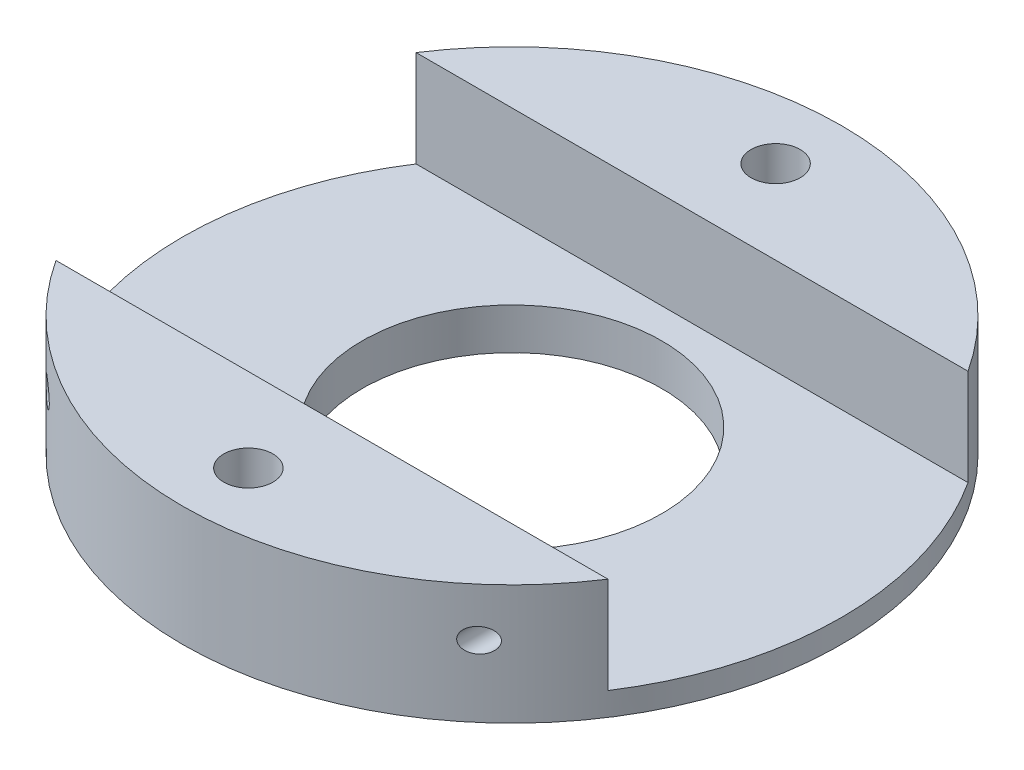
ISO-10303-21;
HEADER;
FILE_DESCRIPTION(('STEP AP214'),'2;1');
FILE_NAME('part.step','',(''),(''),'','','');
FILE_SCHEMA(('AUTOMOTIVE_DESIGN { 1 0 10303 214 1 1 1 1 }'));
ENDSEC;
DATA;
#1=APPLICATION_CONTEXT('core data for automotive mechanical design processes');
#2=APPLICATION_PROTOCOL_DEFINITION('international standard','automotive_design',2000,#1);
#3=PRODUCT_CONTEXT('',#1,'mechanical');
#4=PRODUCT('Part','Part','',(#3));
#5=PRODUCT_RELATED_PRODUCT_CATEGORY('part','',(#4));
#6=PRODUCT_DEFINITION_FORMATION('','',#4);
#7=PRODUCT_DEFINITION_CONTEXT('part definition',#1,'design');
#8=PRODUCT_DEFINITION('design','',#6,#7);
#9=PRODUCT_DEFINITION_SHAPE('','',#8);
#10=(LENGTH_UNIT() NAMED_UNIT(*) SI_UNIT(.MILLI.,.METRE.));
#11=(NAMED_UNIT(*) PLANE_ANGLE_UNIT() SI_UNIT($,.RADIAN.));
#12=(NAMED_UNIT(*) SI_UNIT($,.STERADIAN.) SOLID_ANGLE_UNIT());
#13=UNCERTAINTY_MEASURE_WITH_UNIT(LENGTH_MEASURE(1.E-05),#10,'distance_accuracy_value','');
#14=(GEOMETRIC_REPRESENTATION_CONTEXT(3) GLOBAL_UNCERTAINTY_ASSIGNED_CONTEXT((#13)) GLOBAL_UNIT_ASSIGNED_CONTEXT((#10,
#11,#12)) REPRESENTATION_CONTEXT('',''));
#15=CARTESIAN_POINT('',(0.,0.,0.));
#16=DIRECTION('',(0.,0.,1.));
#17=DIRECTION('',(1.,0.,0.));
#18=AXIS2_PLACEMENT_3D('',#15,#16,#17);
#19=CARTESIAN_POINT('',(0.,0.,0.));
#20=DIRECTION('',(0.,1.,0.));
#21=DIRECTION('',(0.,0.,1.));
#22=AXIS2_PLACEMENT_3D('',#19,#20,#21);
#23=PLANE('',#22);
#24=CARTESIAN_POINT('',(0.,0.,0.));
#25=DIRECTION('',(0.,1.,0.));
#26=DIRECTION('',(0.,0.,1.));
#27=AXIS2_PLACEMENT_3D('',#24,#25,#26);
#28=CIRCLE('',#27,27.5);
#29=CARTESIAN_POINT('',(0.,0.,27.5));
#30=VERTEX_POINT('',#29);
#31=EDGE_CURVE('E107',#30,#30,#28,.T.);
#32=ORIENTED_EDGE('',*,*,#31,.F.);
#33=EDGE_LOOP('',(#32));
#34=FACE_BOUND('',#33,.T.);
#35=CARTESIAN_POINT('',(0.,0.,22.));
#36=DIRECTION('',(0.,1.,0.));
#37=DIRECTION('',(0.,0.,1.));
#38=AXIS2_PLACEMENT_3D('',#35,#36,#37);
#39=CIRCLE('',#38,2.05);
#40=CARTESIAN_POINT('',(0.,0.,24.05));
#41=VERTEX_POINT('',#40);
#42=EDGE_CURVE('E187',#41,#41,#39,.T.);
#43=ORIENTED_EDGE('',*,*,#42,.T.);
#44=EDGE_LOOP('',(#43));
#45=FACE_BOUND('',#44,.T.);
#46=CARTESIAN_POINT('',(0.,0.,-22.));
#47=DIRECTION('',(0.,1.,0.));
#48=DIRECTION('',(0.,0.,1.));
#49=AXIS2_PLACEMENT_3D('',#46,#47,#48);
#50=CIRCLE('',#49,2.05);
#51=CARTESIAN_POINT('',(0.,0.,-19.95));
#52=VERTEX_POINT('',#51);
#53=EDGE_CURVE('E191',#52,#52,#50,.T.);
#54=ORIENTED_EDGE('',*,*,#53,.T.);
#55=EDGE_LOOP('',(#54));
#56=FACE_BOUND('',#55,.T.);
#57=CARTESIAN_POINT('',(0.,0.,0.));
#58=DIRECTION('',(0.,1.,0.));
#59=DIRECTION('',(0.,0.,1.));
#60=AXIS2_PLACEMENT_3D('',#57,#58,#59);
#61=CIRCLE('',#60,14.45);
#62=CARTESIAN_POINT('',(0.,0.,14.45));
#63=VERTEX_POINT('',#62);
#64=EDGE_CURVE('E11',#63,#63,#61,.F.);
#65=ORIENTED_EDGE('',*,*,#64,.F.);
#66=EDGE_LOOP('',(#65));
#67=FACE_BOUND('',#66,.T.);
#68=ADVANCED_FACE('F43',(#34,#45,#56,#67),#23,.F.);
#69=CARTESIAN_POINT('',(0.,10.,0.));
#70=DIRECTION('',(0.,-1.,0.));
#71=DIRECTION('',(0.,0.,-1.));
#72=AXIS2_PLACEMENT_3D('',#69,#70,#71);
#73=CYLINDRICAL_SURFACE('',#72,27.5);
#74=CARTESIAN_POINT('',(-19.,5.95,19.880895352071));
#75=CARTESIAN_POINT('',(-18.9999972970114,5.904632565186,19.8808980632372));
#76=CARTESIAN_POINT('',(-18.9968872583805,5.85924397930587,19.8838715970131));
#77=CARTESIAN_POINT('',(-18.984703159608,5.77001735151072,19.8955048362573));
#78=CARTESIAN_POINT('',(-18.9756234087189,5.72618083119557,19.9041699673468));
#79=CARTESIAN_POINT('',(-18.9522609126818,5.64159543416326,19.9264161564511));
#80=CARTESIAN_POINT('',(-18.9380125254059,5.60082826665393,19.9399647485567));
#81=CARTESIAN_POINT('',(-18.9051462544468,5.52279185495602,19.971128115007));
#82=CARTESIAN_POINT('',(-18.8865264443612,5.48552416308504,19.988744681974));
#83=CARTESIAN_POINT('',(-18.8376052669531,5.40075355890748,20.0348733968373));
#84=CARTESIAN_POINT('',(-18.8056031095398,5.3550742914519,20.0649324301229));
#85=CARTESIAN_POINT('',(-18.7364814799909,5.27135782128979,20.1294936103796));
#86=CARTESIAN_POINT('',(-18.6993512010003,5.2333371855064,20.1640051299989));
#87=CARTESIAN_POINT('',(-18.6083529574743,5.15331915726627,20.248066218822));
#88=CARTESIAN_POINT('',(-18.5530303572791,5.11421804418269,20.2987948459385));
#89=CARTESIAN_POINT('',(-18.4380587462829,5.04861690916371,20.4032852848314));
#90=CARTESIAN_POINT('',(-18.3784069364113,5.02212512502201,20.4570490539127));
#91=CARTESIAN_POINT('',(-18.2552200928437,4.98089882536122,20.5670581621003));
#92=CARTESIAN_POINT('',(-18.1916331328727,4.96639474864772,20.6233311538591));
#93=CARTESIAN_POINT('',(-18.0629951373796,4.94988035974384,20.7360925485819));
#94=CARTESIAN_POINT('',(-17.9979432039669,4.94787793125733,20.7925810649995));
#95=CARTESIAN_POINT('',(-17.8585120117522,4.95725823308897,20.9125117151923));
#96=CARTESIAN_POINT('',(-17.7841207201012,4.97058316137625,20.975801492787));
#97=CARTESIAN_POINT('',(-17.6377634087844,5.01479361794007,21.0990143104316));
#98=CARTESIAN_POINT('',(-17.5657941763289,5.04565482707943,21.1589418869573));
#99=CARTESIAN_POINT('',(-17.4496391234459,5.11329171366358,21.2547375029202));
#100=CARTESIAN_POINT('',(-17.4038723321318,5.14509950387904,21.2922148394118));
#101=CARTESIAN_POINT('',(-17.3166346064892,5.21772856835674,21.363223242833));
#102=CARTESIAN_POINT('',(-17.2751567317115,5.25853493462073,21.3967606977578));
#103=CARTESIAN_POINT('',(-17.2057268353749,5.34053785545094,21.4526121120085));
#104=CARTESIAN_POINT('',(-17.1767014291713,5.38019305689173,21.4758483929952));
#105=CARTESIAN_POINT('',(-17.1240134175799,5.46508898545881,21.5178832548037));
#106=CARTESIAN_POINT('',(-17.1003494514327,5.51032829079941,21.5366829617));
#107=CARTESIAN_POINT('',(-17.0595919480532,5.6059724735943,21.568982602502));
#108=CARTESIAN_POINT('',(-17.0425547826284,5.65641723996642,21.5824370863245));
#109=CARTESIAN_POINT('',(-17.0166373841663,5.76060763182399,21.6028778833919));
#110=CARTESIAN_POINT('',(-17.0077486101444,5.81434973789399,21.6098709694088));
#111=CARTESIAN_POINT('',(-16.9995058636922,5.9152885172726,21.6163553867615));
#112=CARTESIAN_POINT('',(-16.9989798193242,5.96233425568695,21.6167688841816));
#113=CARTESIAN_POINT('',(-17.0045113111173,6.05578574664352,21.6124179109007));
#114=CARTESIAN_POINT('',(-17.0105671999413,6.10219165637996,21.6076547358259));
#115=CARTESIAN_POINT('',(-17.0283906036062,6.19064254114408,21.5936108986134));
#116=CARTESIAN_POINT('',(-17.0398520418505,6.23278927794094,21.5845722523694));
#117=CARTESIAN_POINT('',(-17.0677231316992,6.31430289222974,21.5625402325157));
#118=CARTESIAN_POINT('',(-17.0841335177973,6.35366935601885,21.5495462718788));
#119=CARTESIAN_POINT('',(-17.1227160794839,6.4321206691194,21.5189044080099));
#120=CARTESIAN_POINT('',(-17.1452551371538,6.47090709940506,21.500958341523));
#121=CARTESIAN_POINT('',(-17.1943255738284,6.54399549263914,21.4617370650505));
#122=CARTESIAN_POINT('',(-17.2208595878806,6.57829446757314,21.4404596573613));
#123=CARTESIAN_POINT('',(-17.289619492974,6.65650401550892,21.3850827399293));
#124=CARTESIAN_POINT('',(-17.333561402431,6.69786687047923,21.3495004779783));
#125=CARTESIAN_POINT('',(-17.4258367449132,6.7708609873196,21.2742515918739));
#126=CARTESIAN_POINT('',(-17.4741789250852,6.80247229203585,21.2345768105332));
#127=CARTESIAN_POINT('',(-17.5865214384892,6.86329422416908,21.1416849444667));
#128=CARTESIAN_POINT('',(-17.651323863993,6.88974157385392,21.0876296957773));
#129=CARTESIAN_POINT('',(-17.782778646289,6.92852848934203,20.9768966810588));
#130=CARTESIAN_POINT('',(-17.8494316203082,6.94086328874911,20.9202180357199));
#131=CARTESIAN_POINT('',(-17.9835732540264,6.95215281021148,20.8050232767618));
#132=CARTESIAN_POINT('',(-18.05106286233,6.95095509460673,20.7464936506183));
#133=CARTESIAN_POINT('',(-18.1846478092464,6.93510645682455,20.6295050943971));
#134=CARTESIAN_POINT('',(-18.2507413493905,6.92043914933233,20.5710463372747));
#135=CARTESIAN_POINT('',(-18.3865936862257,6.87530749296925,20.4497503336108));
#136=CARTESIAN_POINT('',(-18.4560248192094,6.84336653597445,20.3870853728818));
#137=CARTESIAN_POINT('',(-18.5885039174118,6.76220076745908,20.2663633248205));
#138=CARTESIAN_POINT('',(-18.6515692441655,6.71302469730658,20.2082938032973));
#139=CARTESIAN_POINT('',(-18.7432652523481,6.62071374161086,20.1231750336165));
#140=CARTESIAN_POINT('',(-18.7753099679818,6.58357002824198,20.0932677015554));
#141=CARTESIAN_POINT('',(-18.8347127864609,6.5029487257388,20.0375955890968));
#142=CARTESIAN_POINT('',(-18.8620780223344,6.45948096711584,20.0118245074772));
#143=CARTESIAN_POINT('',(-18.9061683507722,6.37507654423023,19.9701664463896));
#144=CARTESIAN_POINT('',(-18.9239249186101,6.33514979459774,19.9533331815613));
#145=CARTESIAN_POINT('',(-18.9543951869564,6.25180988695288,19.9243907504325));
#146=CARTESIAN_POINT('',(-18.9671159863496,6.20840174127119,19.9122749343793));
#147=CARTESIAN_POINT('',(-18.9844591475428,6.12915799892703,19.8957387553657));
#148=CARTESIAN_POINT('',(-18.9902584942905,6.09381023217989,19.8902013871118));
#149=CARTESIAN_POINT('',(-18.9980299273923,6.02231277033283,19.8827786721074));
#150=CARTESIAN_POINT('',(-19.0000021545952,5.98616310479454,19.8808931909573));
#151=CARTESIAN_POINT('',(-19.,5.95,19.880895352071));
#152=B_SPLINE_CURVE_WITH_KNOTS('',3,(#74,#75,#76,#77,#78,#79,#80,#81,#82,#83,#84,#85,#86,#87,
#88,#89,#90,#91,#92,#93,#94,#95,#96,#97,#98,#99,#100,#101,#102,#103,#104,#105,#106,#107,#108,
#109,#110,#111,#112,#113,#114,#115,#116,#117,#118,#119,#120,#121,#122,#123,#124,#125,#126,#127,
#128,#129,#130,#131,#132,#133,#134,#135,#136,#137,#138,#139,#140,#141,#142,#143,#144,#145,#146,
#147,#148,#149,#150,#151),.UNSPECIFIED.,.T.,.F.,(4,2,2,2,2,2,2,2,2,2,2,2,2,2,2,2,2,2,2,2,2,2,2,
2,2,2,2,2,2,2,2,2,2,2,2,2,2,2,4),(0.,0.135944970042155,0.272019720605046,0.407206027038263,
0.542452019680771,0.73148350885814,0.920919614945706,1.17347759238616,1.42620034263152,
1.68367505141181,1.94131211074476,2.23555446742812,2.52938976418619,2.73017399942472,
2.93062806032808,3.09307022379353,3.25547111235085,3.41922475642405,3.58280656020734,
3.72322124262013,3.86360078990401,3.99684244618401,4.13010388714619,4.27450104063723,
4.41899385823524,4.62801217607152,4.83745546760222,5.10137821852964,5.36539008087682,
5.63237885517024,5.89969284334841,6.19464731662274,6.48877429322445,6.6605942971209,
6.83215001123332,6.97208866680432,7.11182934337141,7.2201972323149,7.32856113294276),.UNSPECIFIED.);
#153=CARTESIAN_POINT('',(-19.,5.95,19.880895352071));
#154=VERTEX_POINT('',#153);
#155=EDGE_CURVE('E118',#154,#154,#152,.T.);
#156=ORIENTED_EDGE('',*,*,#155,.F.);
#157=EDGE_LOOP('',(#156));
#158=FACE_BOUND('',#157,.T.);
#159=CARTESIAN_POINT('',(0.,1.95,0.));
#160=DIRECTION('',(0.,-1.,0.));
#161=DIRECTION('',(0.,0.,-1.));
#162=AXIS2_PLACEMENT_3D('',#159,#160,#161);
#163=CIRCLE('',#162,27.5);
#164=CARTESIAN_POINT('',(23.0325720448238,1.95,-15.025));
#165=VERTEX_POINT('',#164);
#166=CARTESIAN_POINT('',(23.0325720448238,1.95,15.025));
#167=VERTEX_POINT('',#166);
#168=EDGE_CURVE('E52',#165,#167,#163,.T.);
#169=ORIENTED_EDGE('',*,*,#168,.T.);
#170=DIRECTION('',(0.,-1.,0.));
#171=VECTOR('',#170,1.);
#172=CARTESIAN_POINT('',(23.0325720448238,10.,15.025));
#173=LINE('',#172,#171);
#174=CARTESIAN_POINT('',(23.0325720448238,10.,15.025));
#175=VERTEX_POINT('',#174);
#176=EDGE_CURVE('E67',#167,#175,#173,.F.);
#177=ORIENTED_EDGE('',*,*,#176,.T.);
#178=CARTESIAN_POINT('',(0.,10.,0.));
#179=DIRECTION('',(0.,1.,0.));
#180=DIRECTION('',(0.,0.,1.));
#181=AXIS2_PLACEMENT_3D('',#178,#179,#180);
#182=CIRCLE('',#181,27.5);
#183=CARTESIAN_POINT('',(-23.0325720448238,10.,15.025));
#184=VERTEX_POINT('',#183);
#185=EDGE_CURVE('E104',#184,#175,#182,.T.);
#186=ORIENTED_EDGE('',*,*,#185,.F.);
#187=DIRECTION('',(0.,-1.,0.));
#188=VECTOR('',#187,1.);
#189=CARTESIAN_POINT('',(-23.0325720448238,10.,15.025));
#190=LINE('',#189,#188);
#191=CARTESIAN_POINT('',(-23.0325720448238,1.95,15.025));
#192=VERTEX_POINT('',#191);
#193=EDGE_CURVE('E110',#184,#192,#190,.T.);
#194=ORIENTED_EDGE('',*,*,#193,.T.);
#195=CARTESIAN_POINT('',(-23.0325720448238,1.95,-15.025));
#196=VERTEX_POINT('',#195);
#197=EDGE_CURVE('E100',#192,#196,#163,.T.);
#198=ORIENTED_EDGE('',*,*,#197,.T.);
#199=DIRECTION('',(0.,-1.,0.));
#200=VECTOR('',#199,1.);
#201=CARTESIAN_POINT('',(-23.0325720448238,10.,-15.025));
#202=LINE('',#201,#200);
#203=CARTESIAN_POINT('',(-23.0325720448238,10.,-15.025));
#204=VERTEX_POINT('',#203);
#205=EDGE_CURVE('E87',#196,#204,#202,.F.);
#206=ORIENTED_EDGE('',*,*,#205,.T.);
#207=CARTESIAN_POINT('',(23.0325720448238,10.,-15.025));
#208=VERTEX_POINT('',#207);
#209=EDGE_CURVE('E93',#208,#204,#182,.T.);
#210=ORIENTED_EDGE('',*,*,#209,.F.);
#211=DIRECTION('',(0.,-1.,0.));
#212=VECTOR('',#211,1.);
#213=CARTESIAN_POINT('',(23.0325720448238,10.,-15.025));
#214=LINE('',#213,#212);
#215=EDGE_CURVE('E59',#208,#165,#214,.T.);
#216=ORIENTED_EDGE('',*,*,#215,.T.);
#217=EDGE_LOOP('',(#169,#177,#186,#194,#198,#206,#210,#216));
#218=FACE_BOUND('',#217,.T.);
#219=ORIENTED_EDGE('',*,*,#31,.T.);
#220=EDGE_LOOP('',(#219));
#221=FACE_BOUND('',#220,.T.);
#222=CARTESIAN_POINT('',(17.,5.95,21.6159663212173));
#223=CARTESIAN_POINT('',(17.0000066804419,5.90265618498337,21.6159613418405));
#224=CARTESIAN_POINT('',(17.0033903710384,5.85523664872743,21.6133013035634));
#225=CARTESIAN_POINT('',(17.0167216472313,5.76184350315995,21.6028065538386));
#226=CARTESIAN_POINT('',(17.0266869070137,5.71587413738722,21.5949579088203));
#227=CARTESIAN_POINT('',(17.0524802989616,5.62698903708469,21.5745957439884));
#228=CARTESIAN_POINT('',(17.0682778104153,5.58405872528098,21.5621065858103));
#229=CARTESIAN_POINT('',(17.1048770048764,5.5019162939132,21.5330844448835));
#230=CARTESIAN_POINT('',(17.1256771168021,5.46270301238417,21.5165527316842));
#231=CARTESIAN_POINT('',(17.1729970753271,5.38586938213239,21.4788069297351));
#232=CARTESIAN_POINT('',(17.1998175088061,5.34855810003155,21.4573442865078));
#233=CARTESIAN_POINT('',(17.2571266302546,5.27905099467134,21.4112806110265));
#234=CARTESIAN_POINT('',(17.287618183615,5.2468592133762,21.3866771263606));
#235=CARTESIAN_POINT('',(17.3668862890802,5.17324627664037,21.3224050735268));
#236=CARTESIAN_POINT('',(17.4173474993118,5.13494295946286,21.281226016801));
#237=CARTESIAN_POINT('',(17.5220799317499,5.06941973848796,21.1950780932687));
#238=CARTESIAN_POINT('',(17.5763571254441,5.04221768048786,21.1501032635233));
#239=CARTESIAN_POINT('',(17.6878000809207,4.99806833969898,21.0569958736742));
#240=CARTESIAN_POINT('',(17.7449966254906,4.98127810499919,21.0088265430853));
#241=CARTESIAN_POINT('',(17.8601650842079,4.95808354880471,20.9110071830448));
#242=CARTESIAN_POINT('',(17.9181369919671,4.95167914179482,20.8613571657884));
#243=CARTESIAN_POINT('',(18.0461037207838,4.94860265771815,20.7508243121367));
#244=CARTESIAN_POINT('',(18.1160367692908,4.95428676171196,20.6897956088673));
#245=CARTESIAN_POINT('',(18.2538052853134,4.98020646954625,20.5683501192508));
#246=CARTESIAN_POINT('',(18.3216395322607,5.00045038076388,20.5079337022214));
#247=CARTESIAN_POINT('',(18.4442411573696,5.05197753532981,20.3976913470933));
#248=CARTESIAN_POINT('',(18.499523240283,5.08136162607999,20.3475509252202));
#249=CARTESIAN_POINT('',(18.6055469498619,5.15165909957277,20.2506481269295));
#250=CARTESIAN_POINT('',(18.6562955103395,5.19255446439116,20.2038806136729));
#251=CARTESIAN_POINT('',(18.7384104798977,5.2738792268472,20.12769819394));
#252=CARTESIAN_POINT('',(18.7713339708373,5.31151726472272,20.096984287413));
#253=CARTESIAN_POINT('',(18.8323445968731,5.39340320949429,20.039823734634));
#254=CARTESIAN_POINT('',(18.8604385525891,5.43764162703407,20.0133710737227));
#255=CARTESIAN_POINT('',(18.9051845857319,5.52284138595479,19.9710978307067));
#256=CARTESIAN_POINT('',(18.9230015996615,5.56265563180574,19.9542089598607));
#257=CARTESIAN_POINT('',(18.9536329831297,5.64579346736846,19.9251159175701));
#258=CARTESIAN_POINT('',(18.966450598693,5.68911475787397,19.9129087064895));
#259=CARTESIAN_POINT('',(18.9862752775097,5.77861018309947,19.8940077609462));
#260=CARTESIAN_POINT('',(18.9932389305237,5.82480294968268,19.8873552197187));
#261=CARTESIAN_POINT('',(19.0005877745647,5.91817770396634,19.8803343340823));
#262=CARTESIAN_POINT('',(19.0009767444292,5.9653591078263,19.8799623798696));
#263=CARTESIAN_POINT('',(18.9955052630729,6.05333927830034,19.8851901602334));
#264=CARTESIAN_POINT('',(18.9903817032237,6.09423044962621,19.8900857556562));
#265=CARTESIAN_POINT('',(18.9753721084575,6.17429628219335,19.9044055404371));
#266=CARTESIAN_POINT('',(18.9654854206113,6.21347070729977,19.9138303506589));
#267=CARTESIAN_POINT('',(18.94115602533,6.29044980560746,19.9369730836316));
#268=CARTESIAN_POINT('',(18.9265824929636,6.32817524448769,19.9508141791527));
#269=CARTESIAN_POINT('',(18.8937027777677,6.4004148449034,19.9819545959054));
#270=CARTESIAN_POINT('',(18.8753946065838,6.43492728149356,19.9992557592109));
#271=CARTESIAN_POINT('',(18.8255548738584,6.51728668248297,20.0462008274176));
#272=CARTESIAN_POINT('',(18.7920489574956,6.56292708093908,20.0776320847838));
#273=CARTESIAN_POINT('',(18.7199200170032,6.64625200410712,20.1449011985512));
#274=CARTESIAN_POINT('',(18.6812846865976,6.68391681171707,20.1807496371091));
#275=CARTESIAN_POINT('',(18.5870498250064,6.76257111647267,20.2676317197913));
#276=CARTESIAN_POINT('',(18.5300360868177,6.80061558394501,20.3197958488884));
#277=CARTESIAN_POINT('',(18.4118028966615,6.86373680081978,20.426989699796));
#278=CARTESIAN_POINT('',(18.3505813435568,6.88880701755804,20.4820208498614));
#279=CARTESIAN_POINT('',(18.2244437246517,6.92674704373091,20.594341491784));
#280=CARTESIAN_POINT('',(18.1594817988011,6.93939604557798,20.651653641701));
#281=CARTESIAN_POINT('',(18.0282785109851,6.95177096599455,20.766289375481));
#282=CARTESIAN_POINT('',(17.9620362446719,6.95148738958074,20.8236129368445));
#283=CARTESIAN_POINT('',(17.8214738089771,6.93677881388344,20.9440841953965));
#284=CARTESIAN_POINT('',(17.7471816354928,6.92058610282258,21.0070615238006));
#285=CARTESIAN_POINT('',(17.6015326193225,6.87039960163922,21.1292458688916));
#286=CARTESIAN_POINT('',(17.5301709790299,6.83643626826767,21.1884591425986));
#287=CARTESIAN_POINT('',(17.4170040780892,6.76423856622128,21.2814807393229));
#288=CARTESIAN_POINT('',(17.3733299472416,6.73128187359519,21.3171357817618));
#289=CARTESIAN_POINT('',(17.2904211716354,6.65681723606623,21.3844374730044));
#290=CARTESIAN_POINT('',(17.2511789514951,6.61532423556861,21.4160909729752));
#291=CARTESIAN_POINT('',(17.1856269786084,6.53228851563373,21.4687136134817));
#292=CARTESIAN_POINT('',(17.158265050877,6.49214746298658,21.4905777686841));
#293=CARTESIAN_POINT('',(17.1089617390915,6.40660025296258,21.5298495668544));
#294=CARTESIAN_POINT('',(17.0870220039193,6.36119250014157,21.5472558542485));
#295=CARTESIAN_POINT('',(17.0497137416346,6.26561320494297,21.5767893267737));
#296=CARTESIAN_POINT('',(17.0344049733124,6.21540312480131,21.5888685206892));
#297=CARTESIAN_POINT('',(17.0118451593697,6.11222006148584,21.6066503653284));
#298=CARTESIAN_POINT('',(17.0045654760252,6.05925760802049,21.6123756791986));
#299=CARTESIAN_POINT('',(17.0005210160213,5.98736824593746,21.6155564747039));
#300=CARTESIAN_POINT('',(16.9999973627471,5.96869002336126,21.615968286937));
#301=CARTESIAN_POINT('',(17.,5.95,21.6159663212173));
#302=B_SPLINE_CURVE_WITH_KNOTS('',3,(#222,#223,#224,#225,#226,#227,#228,#229,#230,#231,#232,
#233,#234,#235,#236,#237,#238,#239,#240,#241,#242,#243,#244,#245,#246,#247,#248,#249,#250,#251,
#252,#253,#254,#255,#256,#257,#258,#259,#260,#261,#262,#263,#264,#265,#266,#267,#268,#269,#270,
#271,#272,#273,#274,#275,#276,#277,#278,#279,#280,#281,#282,#283,#284,#285,#286,#287,#288,#289,
#290,#291,#292,#293,#294,#295,#296,#297,#298,#299,#300,#301),.UNSPECIFIED.,.T.,.F.,(4,2,2,2,2,2,
2,2,2,2,2,2,2,2,2,2,2,2,2,2,2,2,2,2,2,2,2,2,2,2,2,2,2,2,2,2,2,2,2,4),(0.,0.141973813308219,
0.284330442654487,0.425950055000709,0.567525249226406,0.719118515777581,0.870830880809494,
1.096273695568,1.32207750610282,1.55120930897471,1.7803392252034,2.05813830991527,
2.33609602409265,2.57585952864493,2.81524981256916,2.9907185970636,3.16593749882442,
3.30571467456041,3.44540094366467,3.58611414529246,3.72674646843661,3.85067281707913,
3.97461615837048,4.10237313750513,4.23019831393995,4.42339216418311,4.61705818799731,
4.8740960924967,5.13126329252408,5.3929234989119,5.65477581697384,5.94944276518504,
6.2436063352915,6.43884104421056,6.63373682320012,6.79292820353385,6.95216793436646,
7.11281431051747,7.27288582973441,7.32893314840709),.UNSPECIFIED.);
#303=CARTESIAN_POINT('',(17.,5.95,21.6159663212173));
#304=VERTEX_POINT('',#303);
#305=EDGE_CURVE('E119',#304,#304,#302,.T.);
#306=ORIENTED_EDGE('',*,*,#305,.F.);
#307=EDGE_LOOP('',(#306));
#308=FACE_BOUND('',#307,.T.);
#309=ADVANCED_FACE('F45',(#158,#218,#221,#308),#73,.T.);
#310=CARTESIAN_POINT('',(-30.,1.95,15.025));
#311=DIRECTION('',(0.,0.,1.));
#312=DIRECTION('',(1.,0.,0.));
#313=AXIS2_PLACEMENT_3D('',#310,#311,#312);
#314=PLANE('',#313);
#315=CARTESIAN_POINT('',(-18.,5.95,15.025));
#316=DIRECTION('',(0.,0.,1.));
#317=DIRECTION('',(1.,0.,0.));
#318=AXIS2_PLACEMENT_3D('',#315,#316,#317);
#319=CIRCLE('',#318,1.);
#320=CARTESIAN_POINT('',(-17.,5.95,15.025));
#321=VERTEX_POINT('',#320);
#322=EDGE_CURVE('E116',#321,#321,#319,.F.);
#323=ORIENTED_EDGE('',*,*,#322,.F.);
#324=EDGE_LOOP('',(#323));
#325=FACE_BOUND('',#324,.T.);
#326=DIRECTION('',(1.,0.,0.));
#327=VECTOR('',#326,1.);
#328=CARTESIAN_POINT('',(0.,10.,15.025));
#329=LINE('',#328,#327);
#330=EDGE_CURVE('E92',#184,#175,#329,.T.);
#331=ORIENTED_EDGE('',*,*,#330,.T.);
#332=ORIENTED_EDGE('',*,*,#176,.F.);
#333=DIRECTION('',(1.,0.,0.));
#334=VECTOR('',#333,1.);
#335=CARTESIAN_POINT('',(-30.,1.95,15.025));
#336=LINE('',#335,#334);
#337=EDGE_CURVE('E101',#192,#167,#336,.T.);
#338=ORIENTED_EDGE('',*,*,#337,.F.);
#339=ORIENTED_EDGE('',*,*,#193,.F.);
#340=EDGE_LOOP('',(#331,#332,#338,#339));
#341=FACE_BOUND('',#340,.T.);
#342=CARTESIAN_POINT('',(18.,5.95,15.025));
#343=DIRECTION('',(0.,0.,1.));
#344=DIRECTION('',(1.,0.,0.));
#345=AXIS2_PLACEMENT_3D('',#342,#343,#344);
#346=CIRCLE('',#345,1.);
#347=CARTESIAN_POINT('',(19.,5.95,15.025));
#348=VERTEX_POINT('',#347);
#349=EDGE_CURVE('E120',#348,#348,#346,.F.);
#350=ORIENTED_EDGE('',*,*,#349,.F.);
#351=EDGE_LOOP('',(#350));
#352=FACE_BOUND('',#351,.T.);
#353=ADVANCED_FACE('F167',(#325,#341,#352),#314,.F.);
#354=CARTESIAN_POINT('',(0.,10.,0.));
#355=DIRECTION('',(0.,1.,0.));
#356=DIRECTION('',(0.,0.,1.));
#357=AXIS2_PLACEMENT_3D('',#354,#355,#356);
#358=PLANE('',#357);
#359=CARTESIAN_POINT('',(0.,10.,22.));
#360=DIRECTION('',(0.,1.,0.));
#361=DIRECTION('',(0.,0.,1.));
#362=AXIS2_PLACEMENT_3D('',#359,#360,#361);
#363=CIRCLE('',#362,2.04999999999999);
#364=CARTESIAN_POINT('',(0.,10.,24.05));
#365=VERTEX_POINT('',#364);
#366=EDGE_CURVE('E215',#365,#365,#363,.T.);
#367=ORIENTED_EDGE('',*,*,#366,.F.);
#368=EDGE_LOOP('',(#367));
#369=FACE_BOUND('',#368,.T.);
#370=ORIENTED_EDGE('',*,*,#330,.F.);
#371=ORIENTED_EDGE('',*,*,#185,.T.);
#372=EDGE_LOOP('',(#370,#371));
#373=FACE_BOUND('',#372,.T.);
#374=ADVANCED_FACE('F170',(#369,#373),#358,.T.);
#375=CARTESIAN_POINT('',(0.,10.,-22.));
#376=DIRECTION('',(0.,1.,0.));
#377=DIRECTION('',(0.,0.,1.));
#378=AXIS2_PLACEMENT_3D('',#375,#376,#377);
#379=CIRCLE('',#378,2.04999999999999);
#380=CARTESIAN_POINT('',(0.,10.,-19.95));
#381=VERTEX_POINT('',#380);
#382=EDGE_CURVE('E230',#381,#381,#379,.T.);
#383=ORIENTED_EDGE('',*,*,#382,.F.);
#384=EDGE_LOOP('',(#383));
#385=FACE_BOUND('',#384,.T.);
#386=DIRECTION('',(-1.,0.,0.));
#387=VECTOR('',#386,1.);
#388=CARTESIAN_POINT('',(0.,10.,-15.025));
#389=LINE('',#388,#387);
#390=EDGE_CURVE('E84',#208,#204,#389,.T.);
#391=ORIENTED_EDGE('',*,*,#390,.F.);
#392=ORIENTED_EDGE('',*,*,#209,.T.);
#393=EDGE_LOOP('',(#391,#392));
#394=FACE_BOUND('',#393,.T.);
#395=ADVANCED_FACE('F103',(#385,#394),#358,.T.);
#396=CARTESIAN_POINT('',(0.,1.95,0.));
#397=DIRECTION('',(0.,-1.,0.));
#398=DIRECTION('',(0.,0.,-1.));
#399=AXIS2_PLACEMENT_3D('',#396,#397,#398);
#400=PLANE('',#399);
#401=CARTESIAN_POINT('',(0.,1.95,0.));
#402=DIRECTION('',(0.,1.,0.));
#403=DIRECTION('',(0.,0.,1.));
#404=AXIS2_PLACEMENT_3D('',#401,#402,#403);
#405=CIRCLE('',#404,12.5);
#406=CARTESIAN_POINT('',(0.,1.95,12.5));
#407=VERTEX_POINT('',#406);
#408=EDGE_CURVE('E133',#407,#407,#405,.T.);
#409=ORIENTED_EDGE('',*,*,#408,.F.);
#410=EDGE_LOOP('',(#409));
#411=FACE_BOUND('',#410,.T.);
#412=DIRECTION('',(-1.,0.,0.));
#413=VECTOR('',#412,1.);
#414=CARTESIAN_POINT('',(-30.,1.95,-15.025));
#415=LINE('',#414,#413);
#416=EDGE_CURVE('E212',#165,#196,#415,.T.);
#417=ORIENTED_EDGE('',*,*,#416,.T.);
#418=ORIENTED_EDGE('',*,*,#197,.F.);
#419=ORIENTED_EDGE('',*,*,#337,.T.);
#420=ORIENTED_EDGE('',*,*,#168,.F.);
#421=EDGE_LOOP('',(#417,#418,#419,#420));
#422=FACE_BOUND('',#421,.T.);
#423=ADVANCED_FACE('F163',(#411,#422),#400,.F.);
#424=CARTESIAN_POINT('',(-30.,1.95,-15.025));
#425=DIRECTION('',(0.,0.,-1.));
#426=DIRECTION('',(-1.,0.,0.));
#427=AXIS2_PLACEMENT_3D('',#424,#425,#426);
#428=PLANE('',#427);
#429=ORIENTED_EDGE('',*,*,#390,.T.);
#430=ORIENTED_EDGE('',*,*,#205,.F.);
#431=ORIENTED_EDGE('',*,*,#416,.F.);
#432=ORIENTED_EDGE('',*,*,#215,.F.);
#433=EDGE_LOOP('',(#429,#430,#431,#432));
#434=FACE_BOUND('',#433,.T.);
#435=ADVANCED_FACE('F86',(#434),#428,.F.);
#436=CARTESIAN_POINT('',(0.,10.,22.));
#437=DIRECTION('',(0.,1.,0.));
#438=DIRECTION('',(0.,0.,1.));
#439=AXIS2_PLACEMENT_3D('',#436,#437,#438);
#440=CYLINDRICAL_SURFACE('',#439,2.04999999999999);
#441=ORIENTED_EDGE('',*,*,#42,.F.);
#442=EDGE_LOOP('',(#441));
#443=FACE_BOUND('',#442,.T.);
#444=ORIENTED_EDGE('',*,*,#366,.T.);
#445=EDGE_LOOP('',(#444));
#446=FACE_BOUND('',#445,.T.);
#447=ADVANCED_FACE('F158',(#443,#446),#440,.F.);
#448=CARTESIAN_POINT('',(0.,10.,-22.));
#449=DIRECTION('',(0.,1.,0.));
#450=DIRECTION('',(0.,0.,1.));
#451=AXIS2_PLACEMENT_3D('',#448,#449,#450);
#452=CYLINDRICAL_SURFACE('',#451,2.04999999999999);
#453=ORIENTED_EDGE('',*,*,#53,.F.);
#454=EDGE_LOOP('',(#453));
#455=FACE_BOUND('',#454,.T.);
#456=ORIENTED_EDGE('',*,*,#382,.T.);
#457=EDGE_LOOP('',(#456));
#458=FACE_BOUND('',#457,.T.);
#459=ADVANCED_FACE('F154',(#455,#458),#452,.F.);
#460=CARTESIAN_POINT('',(-18.,5.95,25.));
#461=DIRECTION('',(0.,0.,-1.));
#462=DIRECTION('',(-1.,0.,0.));
#463=AXIS2_PLACEMENT_3D('',#460,#461,#462);
#464=CYLINDRICAL_SURFACE('',#463,1.);
#465=ORIENTED_EDGE('',*,*,#322,.T.);
#466=EDGE_LOOP('',(#465));
#467=FACE_BOUND('',#466,.T.);
#468=ORIENTED_EDGE('',*,*,#155,.T.);
#469=EDGE_LOOP('',(#468));
#470=FACE_BOUND('',#469,.T.);
#471=ADVANCED_FACE('F149',(#467,#470),#464,.F.);
#472=CARTESIAN_POINT('',(18.,5.95,25.));
#473=DIRECTION('',(0.,0.,-1.));
#474=DIRECTION('',(-1.,0.,0.));
#475=AXIS2_PLACEMENT_3D('',#472,#473,#474);
#476=CYLINDRICAL_SURFACE('',#475,1.);
#477=ORIENTED_EDGE('',*,*,#349,.T.);
#478=EDGE_LOOP('',(#477));
#479=FACE_BOUND('',#478,.T.);
#480=ORIENTED_EDGE('',*,*,#305,.T.);
#481=EDGE_LOOP('',(#480));
#482=FACE_BOUND('',#481,.T.);
#483=ADVANCED_FACE('F144',(#479,#482),#476,.F.);
#484=CARTESIAN_POINT('',(0.,-1.5,0.));
#485=DIRECTION('',(0.,1.,0.));
#486=DIRECTION('',(0.,0.,1.));
#487=AXIS2_PLACEMENT_3D('',#484,#485,#486);
#488=CYLINDRICAL_SURFACE('',#487,14.45);
#489=CARTESIAN_POINT('',(0.,-1.5,0.));
#490=DIRECTION('',(0.,-1.,0.));
#491=DIRECTION('',(0.,0.,-1.));
#492=AXIS2_PLACEMENT_3D('',#489,#490,#491);
#493=CIRCLE('',#492,14.45);
#494=CARTESIAN_POINT('',(0.,-1.5,-14.45));
#495=VERTEX_POINT('',#494);
#496=EDGE_CURVE('E122',#495,#495,#493,.T.);
#497=ORIENTED_EDGE('',*,*,#496,.F.);
#498=EDGE_LOOP('',(#497));
#499=FACE_BOUND('',#498,.T.);
#500=ORIENTED_EDGE('',*,*,#64,.T.);
#501=EDGE_LOOP('',(#500));
#502=FACE_BOUND('',#501,.T.);
#503=ADVANCED_FACE('F148',(#499,#502),#488,.T.);
#504=CARTESIAN_POINT('',(0.,-1.5,0.));
#505=DIRECTION('',(0.,-1.,0.));
#506=DIRECTION('',(0.,0.,-1.));
#507=AXIS2_PLACEMENT_3D('',#504,#505,#506);
#508=PLANE('',#507);
#509=CARTESIAN_POINT('',(0.,-1.5,0.));
#510=DIRECTION('',(0.,1.,0.));
#511=DIRECTION('',(0.,0.,1.));
#512=AXIS2_PLACEMENT_3D('',#509,#510,#511);
#513=CIRCLE('',#512,12.5);
#514=CARTESIAN_POINT('',(0.,-1.5,12.5));
#515=VERTEX_POINT('',#514);
#516=EDGE_CURVE('E128',#515,#515,#513,.T.);
#517=ORIENTED_EDGE('',*,*,#516,.T.);
#518=EDGE_LOOP('',(#517));
#519=FACE_BOUND('',#518,.T.);
#520=ORIENTED_EDGE('',*,*,#496,.T.);
#521=EDGE_LOOP('',(#520));
#522=FACE_BOUND('',#521,.T.);
#523=ADVANCED_FACE('F195',(#519,#522),#508,.T.);
#524=CARTESIAN_POINT('',(0.,-1.5,0.));
#525=DIRECTION('',(0.,1.,0.));
#526=DIRECTION('',(0.,0.,1.));
#527=AXIS2_PLACEMENT_3D('',#524,#525,#526);
#528=CYLINDRICAL_SURFACE('',#527,12.5);
#529=CARTESIAN_POINT('',(0.,-1.5,12.5));
#530=CARTESIAN_POINT('',(0.,-1.4640625,12.5));
#531=CARTESIAN_POINT('',(0.,-1.428125,12.5));
#532=CARTESIAN_POINT('',(0.,-1.35625,12.5));
#533=CARTESIAN_POINT('',(0.,-1.3203125,12.5));
#534=CARTESIAN_POINT('',(0.,-1.2484375,12.5));
#535=CARTESIAN_POINT('',(0.,-1.2125,12.5));
#536=CARTESIAN_POINT('',(0.,-1.140625,12.5));
#537=CARTESIAN_POINT('',(0.,-1.1046875,12.5));
#538=CARTESIAN_POINT('',(0.,-1.0328125,12.5));
#539=CARTESIAN_POINT('',(0.,-0.996875,12.5));
#540=CARTESIAN_POINT('',(0.,-0.925,12.5));
#541=CARTESIAN_POINT('',(0.,-0.8890625,12.5));
#542=CARTESIAN_POINT('',(0.,-0.8171875,12.5));
#543=CARTESIAN_POINT('',(0.,-0.78125,12.5));
#544=CARTESIAN_POINT('',(0.,-0.709375,12.5));
#545=CARTESIAN_POINT('',(0.,-0.6734375,12.5));
#546=CARTESIAN_POINT('',(0.,-0.6015625,12.5));
#547=CARTESIAN_POINT('',(0.,-0.565625,12.5));
#548=CARTESIAN_POINT('',(0.,-0.49375,12.5));
#549=CARTESIAN_POINT('',(0.,-0.4578125,12.5));
#550=CARTESIAN_POINT('',(0.,-0.3859375,12.5));
#551=CARTESIAN_POINT('',(0.,-0.35,12.5));
#552=CARTESIAN_POINT('',(0.,-0.278125,12.5));
#553=CARTESIAN_POINT('',(0.,-0.2421875,12.5));
#554=CARTESIAN_POINT('',(0.,-0.1703125,12.5));
#555=CARTESIAN_POINT('',(0.,-0.134375,12.5));
#556=CARTESIAN_POINT('',(0.,-0.0625000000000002,12.5));
#557=CARTESIAN_POINT('',(0.,-0.0265625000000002,12.5));
#558=CARTESIAN_POINT('',(0.,0.0453124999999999,12.5));
#559=CARTESIAN_POINT('',(0.,0.0812499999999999,12.5));
#560=CARTESIAN_POINT('',(0.,0.153125,12.5));
#561=CARTESIAN_POINT('',(0.,0.1890625,12.5));
#562=CARTESIAN_POINT('',(0.,0.2609375,12.5));
#563=CARTESIAN_POINT('',(0.,0.296875,12.5));
#564=CARTESIAN_POINT('',(0.,0.36875,12.5));
#565=CARTESIAN_POINT('',(0.,0.4046875,12.5));
#566=CARTESIAN_POINT('',(0.,0.4765625,12.5));
#567=CARTESIAN_POINT('',(0.,0.5125,12.5));
#568=CARTESIAN_POINT('',(0.,0.584375,12.5));
#569=CARTESIAN_POINT('',(0.,0.6203125,12.5));
#570=CARTESIAN_POINT('',(0.,0.6921875,12.5));
#571=CARTESIAN_POINT('',(0.,0.728125,12.5));
#572=CARTESIAN_POINT('',(0.,0.8,12.5));
#573=CARTESIAN_POINT('',(0.,0.8359375,12.5));
#574=CARTESIAN_POINT('',(0.,0.9078125,12.5));
#575=CARTESIAN_POINT('',(0.,0.94375,12.5));
#576=CARTESIAN_POINT('',(0.,1.015625,12.5));
#577=CARTESIAN_POINT('',(0.,1.0515625,12.5));
#578=CARTESIAN_POINT('',(0.,1.1234375,12.5));
#579=CARTESIAN_POINT('',(0.,1.159375,12.5));
#580=CARTESIAN_POINT('',(0.,1.23125,12.5));
#581=CARTESIAN_POINT('',(0.,1.2671875,12.5));
#582=CARTESIAN_POINT('',(0.,1.3390625,12.5));
#583=CARTESIAN_POINT('',(0.,1.375,12.5));
#584=CARTESIAN_POINT('',(0.,1.446875,12.5));
#585=CARTESIAN_POINT('',(0.,1.4828125,12.5));
#586=CARTESIAN_POINT('',(0.,1.5546875,12.5));
#587=CARTESIAN_POINT('',(0.,1.590625,12.5));
#588=CARTESIAN_POINT('',(0.,1.6625,12.5));
#589=CARTESIAN_POINT('',(0.,1.6984375,12.5));
#590=CARTESIAN_POINT('',(0.,1.7703125,12.5));
#591=CARTESIAN_POINT('',(0.,1.80625,12.5));
#592=CARTESIAN_POINT('',(0.,1.878125,12.5));
#593=CARTESIAN_POINT('',(0.,1.9140625,12.5));
#594=CARTESIAN_POINT('',(0.,1.95,12.5));
#595=B_SPLINE_CURVE_WITH_KNOTS('',3,(#529,#530,#531,#532,#533,#534,#535,#536,#537,#538,#539,
#540,#541,#542,#543,#544,#545,#546,#547,#548,#549,#550,#551,#552,#553,#554,#555,#556,#557,#558,
#559,#560,#561,#562,#563,#564,#565,#566,#567,#568,#569,#570,#571,#572,#573,#574,#575,#576,#577,
#578,#579,#580,#581,#582,#583,#584,#585,#586,#587,#588,#589,#590,#591,#592,#593,#594),
.UNSPECIFIED.,.F.,.F.,(4,2,2,2,2,2,2,2,2,2,2,2,2,2,2,2,2,2,2,2,2,2,2,2,2,2,2,2,2,2,2,2,4),(0.,
0.1078125,0.215625,0.3234375,0.43125,0.5390625,0.646875,0.7546875,0.8625,0.9703125,1.078125,
1.1859375,1.29375,1.4015625,1.509375,1.6171875,1.725,1.8328125,1.940625,2.0484375,2.15625,
2.2640625,2.371875,2.4796875,2.5875,2.6953125,2.803125,2.9109375,3.01875,3.1265625,3.234375,
3.3421875,3.45),.UNSPECIFIED.);
#596=EDGE_CURVE('BSEAM200',#515,#407,#595,.T.);
#597=ORIENTED_EDGE('',*,*,#516,.F.);
#598=ORIENTED_EDGE('',*,*,#408,.T.);
#599=ORIENTED_EDGE('',*,*,#596,.T.);
#600=ORIENTED_EDGE('',*,*,#596,.F.);
#601=EDGE_LOOP('',(#597,#599,#598,#600));
#602=FACE_BOUND('',#601,.T.);
#603=ADVANCED_FACE('F200',(#602),#528,.F.);
#604=CLOSED_SHELL('',(#68,#309,#353,#374,#395,#423,#435,#447,#459,#471,#483,#503,#523,#603));
#605=MANIFOLD_SOLID_BREP('B2',#604);
#606=ADVANCED_BREP_SHAPE_REPRESENTATION('',(#18,#605),#14);
#607=SHAPE_DEFINITION_REPRESENTATION(#9,#606);
ENDSEC;
END-ISO-10303-21;
